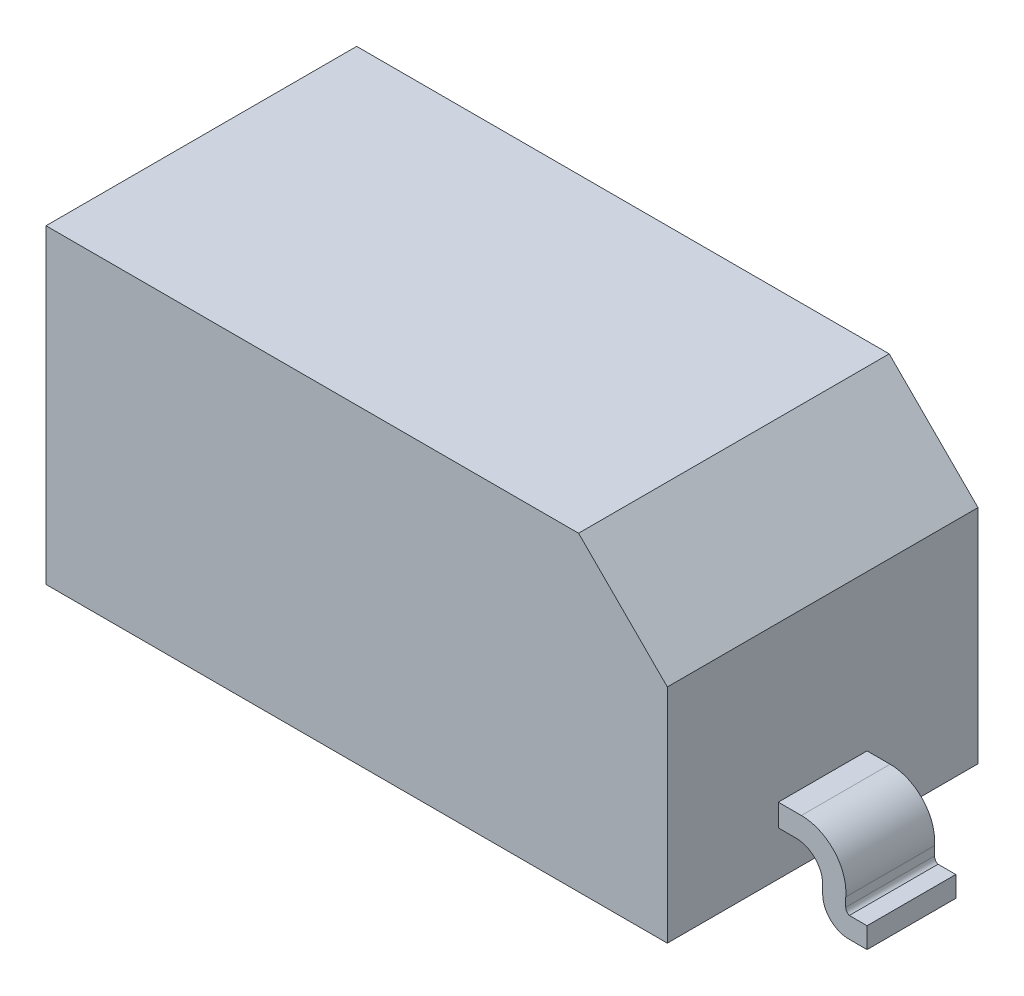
from build123d import *

# Parameters (mm, degrees)
EXTRUDE1_DEPTH = 0.875
EXTRUDE2_DEPTH = 0.25


with BuildPart() as part:
    # Sketch1 → Extrude1 (new, symmetric)
    with BuildSketch(Plane.XY):
        Polygon((-1.75, -0.875), (1.75, -0.875), (1.75, 0.375), (1.25, 0.875), (-1.75, 0.875), align=None)
    extrude(amount=EXTRUDE1_DEPTH, both=True)

    # Sketch2 → Extrude2 (add, symmetric)
    with BuildSketch(Plane.XY):
        with BuildLine():
            Line((1.75, -0.625), (1.85, -0.625))
            ThreePointArc((1.85, -0.625), (1.955, -0.66786607), (2, -0.771969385))
            Line((2, -0.771969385), (2, -0.821969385))
            ThreePointArc((2, -0.821969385), (2.044121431, -0.926969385), (2.15, -0.968938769))
            Line((2.15, -0.968938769), (2.25, -0.968938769))
            Line((2.25, -0.968938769), (2.25, -0.852248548))
            Line((2.25, -0.852248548), (2.15, -0.852248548))
            ThreePointArc((2.15, -0.852248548), (2.135458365, -0.840276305), (2.13, -0.822248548))
            Line((2.13, -0.822248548), (2.13, -0.772248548))
            ThreePointArc((2.13, -0.772248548), (2.065, -0.580874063), (1.88, -0.499484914))
            Line((1.88, -0.499484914), (1.75, -0.499484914))
            Line((1.75, -0.499484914), (1.75, -0.625))
        make_face()
    extrude2 = extrude(amount=EXTRUDE2_DEPTH, both=True)

    # Mirror1: Extrude2 across plane
    add(extrude2.mirror(Plane(origin=(0, 0, 0), x_dir=(0, 0, 1), z_dir=(1, 0, 0))))


solid = part.part
